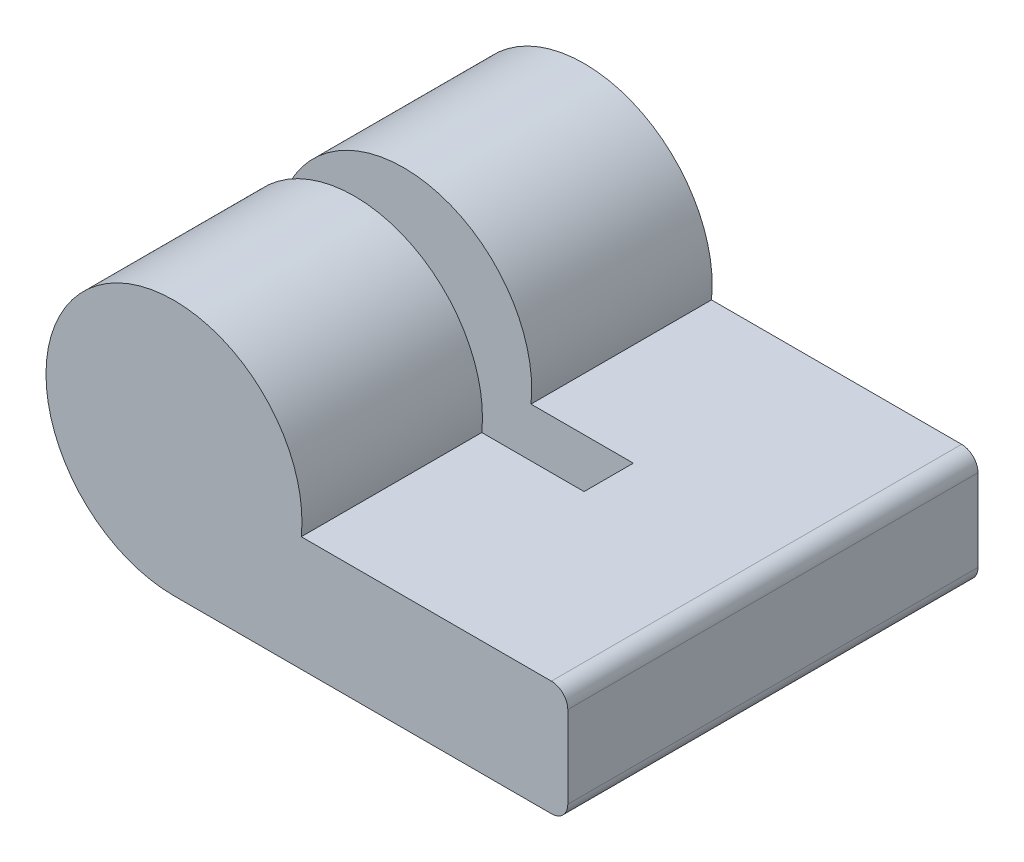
from build123d import *

# Parameters (mm, degrees)
BASE_EXTRUSION_DEPTH    = 12.5
CONG_1_R                = 0.5
ESQUISSE2_R             = 30
ENL_V_MAT_EXTRU_1_DEPTH = 1.5


with BuildPart() as part:
    # Esquisse1 → Base-Extrusion (new body)
    with BuildSketch(Plane.XY):
        with BuildLine():
            Line((0, -3.9), (12, -3.9))
            Line((12, -3.9), (12, -0.4))
            Line((12, -0.4), (3.879432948, -0.4))
            ThreePointArc((3.879432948, -0.4), (-2.612470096, 2.895686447), (0, -3.9))
        make_face()
    extrude(amount=BASE_EXTRUSION_DEPTH)

    # Cong_1
    cong_1_edges = [part.edges().sort_by_distance(p)[0] for p in [
        (12, -0.4, 6.25),
        (12, -3.9, 6.25),
    ]]
    fillet(cong_1_edges, radius=CONG_1_R)

    # Esquisse2 → Enl_v. mat.-Extru.1 (cut)
    with BuildSketch(Plane.XY.offset(7)):
        with Locations((-15, 20)):
            Circle(ESQUISSE2_R)
    extrude(amount=-ENL_V_MAT_EXTRU_1_DEPTH, mode=Mode.SUBTRACT)


solid = part.part
